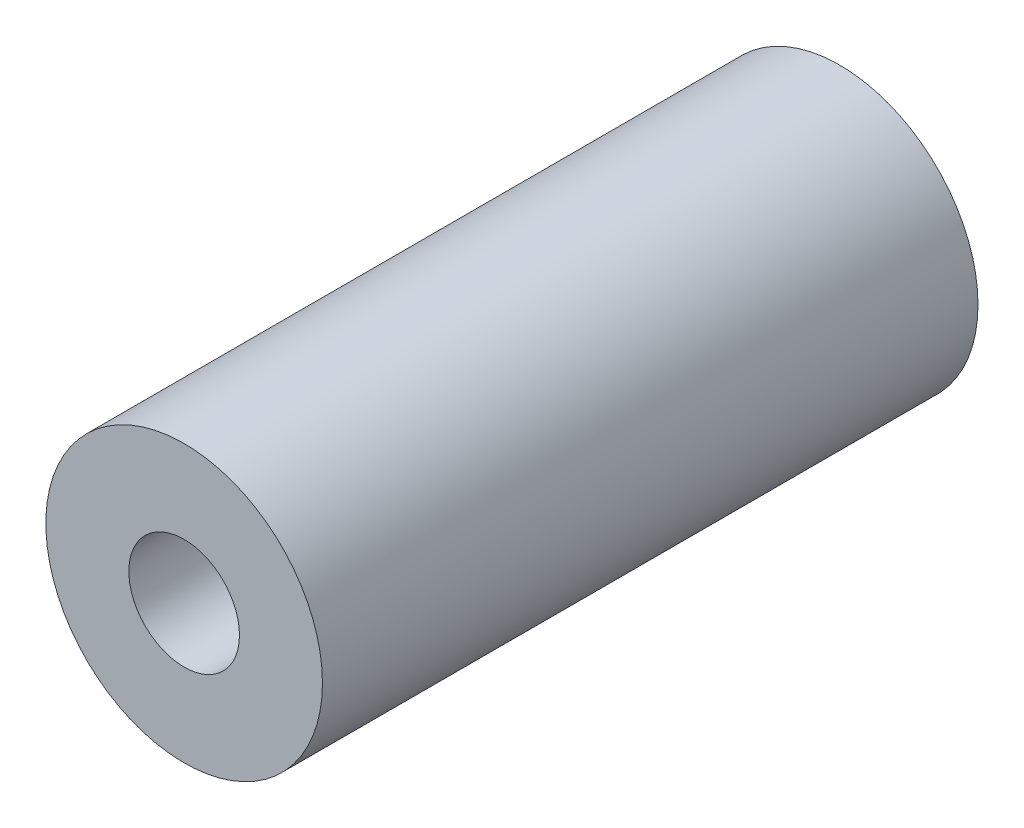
from build123d import *

# Parameters (mm, degrees)
SKIZZE1_R               = 25
SKIZZE1_R_2             = 10
LINEAR_AUSTRAGEN1_DEPTH = 118.5


with BuildPart() as part:
    # Skizze1 → Linear austragen1 (new body)
    with BuildSketch(Plane.XY):
        Circle(SKIZZE1_R)
        Circle(SKIZZE1_R_2, mode=Mode.SUBTRACT)
    extrude(amount=LINEAR_AUSTRAGEN1_DEPTH)


solid = part.part
